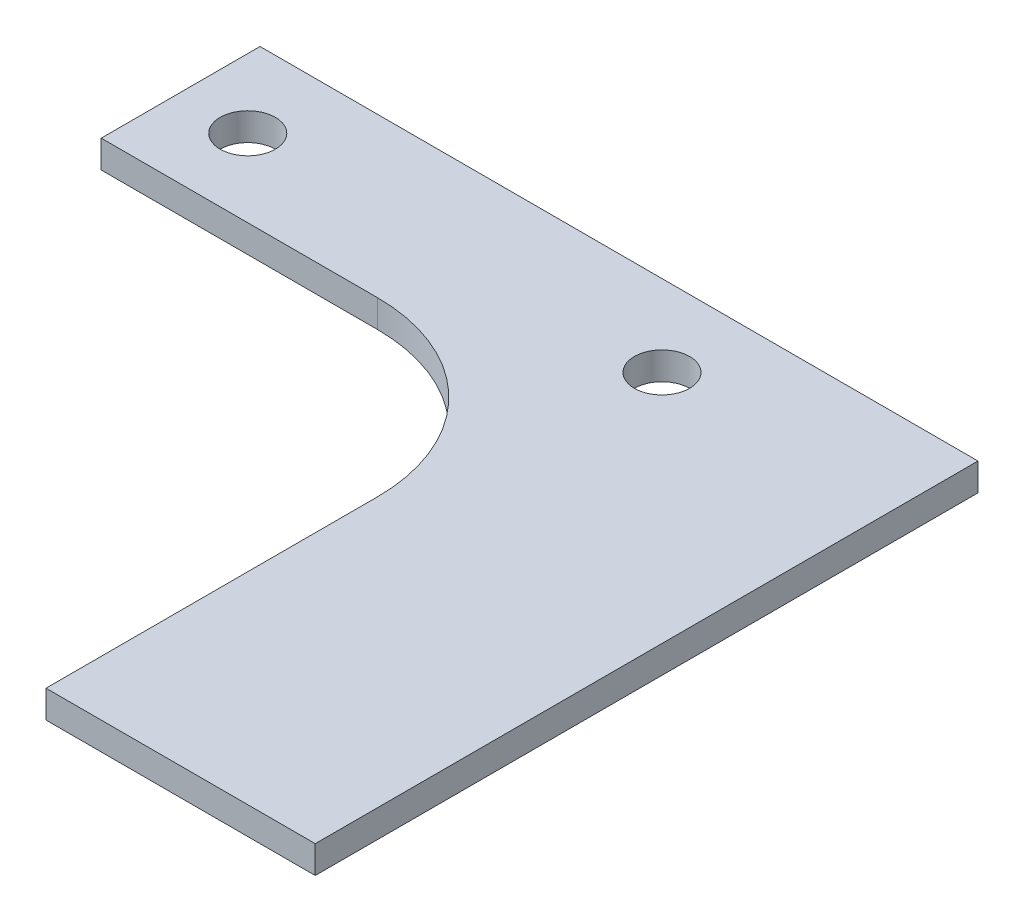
ISO-10303-21;
HEADER;
FILE_DESCRIPTION(('STEP AP214'),'2;1');
FILE_NAME('part.step','',(''),(''),'','','');
FILE_SCHEMA(('AUTOMOTIVE_DESIGN { 1 0 10303 214 1 1 1 1 }'));
ENDSEC;
DATA;
#1=APPLICATION_CONTEXT('core data for automotive mechanical design processes');
#2=APPLICATION_PROTOCOL_DEFINITION('international standard','automotive_design',2000,#1);
#3=PRODUCT_CONTEXT('',#1,'mechanical');
#4=PRODUCT('Part','Part','',(#3));
#5=PRODUCT_RELATED_PRODUCT_CATEGORY('part','',(#4));
#6=PRODUCT_DEFINITION_FORMATION('','',#4);
#7=PRODUCT_DEFINITION_CONTEXT('part definition',#1,'design');
#8=PRODUCT_DEFINITION('design','',#6,#7);
#9=PRODUCT_DEFINITION_SHAPE('','',#8);
#10=(LENGTH_UNIT() NAMED_UNIT(*) SI_UNIT(.MILLI.,.METRE.));
#11=(NAMED_UNIT(*) PLANE_ANGLE_UNIT() SI_UNIT($,.RADIAN.));
#12=(NAMED_UNIT(*) SI_UNIT($,.STERADIAN.) SOLID_ANGLE_UNIT());
#13=UNCERTAINTY_MEASURE_WITH_UNIT(LENGTH_MEASURE(1.E-05),#10,'distance_accuracy_value','');
#14=(GEOMETRIC_REPRESENTATION_CONTEXT(3) GLOBAL_UNCERTAINTY_ASSIGNED_CONTEXT((#13)) GLOBAL_UNIT_ASSIGNED_CONTEXT((#10,
#11,#12)) REPRESENTATION_CONTEXT('',''));
#15=CARTESIAN_POINT('',(0.,0.,0.));
#16=DIRECTION('',(0.,0.,1.));
#17=DIRECTION('',(1.,0.,0.));
#18=AXIS2_PLACEMENT_3D('',#15,#16,#17);
#19=CARTESIAN_POINT('',(25.4,1.5875,-19.05));
#20=DIRECTION('',(-1.,0.,0.));
#21=DIRECTION('',(0.,0.,1.));
#22=AXIS2_PLACEMENT_3D('',#19,#20,#21);
#23=PLANE('',#22);
#24=DIRECTION('',(0.,0.,-1.));
#25=VECTOR('',#24,1.);
#26=CARTESIAN_POINT('',(25.4,1.5875,-19.05));
#27=LINE('',#26,#25);
#28=CARTESIAN_POINT('',(25.4,1.5875,19.0499999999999));
#29=VERTEX_POINT('',#28);
#30=CARTESIAN_POINT('',(25.4,1.5875,-19.05));
#31=VERTEX_POINT('',#30);
#32=EDGE_CURVE('E106',#29,#31,#27,.T.);
#33=ORIENTED_EDGE('',*,*,#32,.F.);
#34=DIRECTION('',(0.,-1.,0.));
#35=VECTOR('',#34,1.);
#36=CARTESIAN_POINT('',(25.4,1.5875,19.0499999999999));
#37=LINE('',#36,#35);
#38=CARTESIAN_POINT('',(25.4,0.,19.0499999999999));
#39=VERTEX_POINT('',#38);
#40=EDGE_CURVE('E131',#29,#39,#37,.T.);
#41=ORIENTED_EDGE('',*,*,#40,.T.);
#42=DIRECTION('',(0.,0.,-1.));
#43=VECTOR('',#42,1.);
#44=CARTESIAN_POINT('',(25.4,0.,-19.05));
#45=LINE('',#44,#43);
#46=CARTESIAN_POINT('',(25.4,0.,-19.05));
#47=VERTEX_POINT('',#46);
#48=EDGE_CURVE('E177',#39,#47,#45,.T.);
#49=ORIENTED_EDGE('',*,*,#48,.T.);
#50=DIRECTION('',(0.,-1.,0.));
#51=VECTOR('',#50,1.);
#52=CARTESIAN_POINT('',(25.4,1.5875,-19.05));
#53=LINE('',#52,#51);
#54=EDGE_CURVE('E11',#31,#47,#53,.T.);
#55=ORIENTED_EDGE('',*,*,#54,.F.);
#56=EDGE_LOOP('',(#33,#41,#49,#55));
#57=FACE_BOUND('',#56,.T.);
#58=ADVANCED_FACE('F42',(#57),#23,.F.);
#59=CARTESIAN_POINT('',(25.4,1.5875,-19.05));
#60=DIRECTION('',(0.,0.,1.));
#61=DIRECTION('',(1.,0.,0.));
#62=AXIS2_PLACEMENT_3D('',#59,#60,#61);
#63=PLANE('',#62);
#64=DIRECTION('',(-1.,0.,0.));
#65=VECTOR('',#64,1.);
#66=CARTESIAN_POINT('',(25.4,0.,-19.05));
#67=LINE('',#66,#65);
#68=CARTESIAN_POINT('',(-15.875,0.,-19.05));
#69=VERTEX_POINT('',#68);
#70=EDGE_CURVE('E174',#47,#69,#67,.T.);
#71=ORIENTED_EDGE('',*,*,#70,.T.);
#72=DIRECTION('',(0.,-1.,0.));
#73=VECTOR('',#72,1.);
#74=CARTESIAN_POINT('',(-15.875,1.5875,-19.05));
#75=LINE('',#74,#73);
#76=CARTESIAN_POINT('',(-15.875,1.5875,-19.05));
#77=VERTEX_POINT('',#76);
#78=EDGE_CURVE('E50',#77,#69,#75,.T.);
#79=ORIENTED_EDGE('',*,*,#78,.F.);
#80=DIRECTION('',(-1.,0.,0.));
#81=VECTOR('',#80,1.);
#82=CARTESIAN_POINT('',(25.4,1.5875,-19.05));
#83=LINE('',#82,#81);
#84=EDGE_CURVE('E148',#31,#77,#83,.T.);
#85=ORIENTED_EDGE('',*,*,#84,.F.);
#86=ORIENTED_EDGE('',*,*,#54,.T.);
#87=EDGE_LOOP('',(#71,#79,#85,#86));
#88=FACE_BOUND('',#87,.T.);
#89=ADVANCED_FACE('F239',(#88),#63,.F.);
#90=CARTESIAN_POINT('',(-15.875,1.5875,-9.921875));
#91=DIRECTION('',(1.,0.,0.));
#92=DIRECTION('',(0.,0.,-1.));
#93=AXIS2_PLACEMENT_3D('',#90,#91,#92);
#94=PLANE('',#93);
#95=DIRECTION('',(0.,0.,1.));
#96=VECTOR('',#95,1.);
#97=CARTESIAN_POINT('',(-15.875,0.,-9.921875));
#98=LINE('',#97,#96);
#99=CARTESIAN_POINT('',(-15.875,0.,-9.921875));
#100=VERTEX_POINT('',#99);
#101=EDGE_CURVE('E151',#69,#100,#98,.T.);
#102=ORIENTED_EDGE('',*,*,#101,.T.);
#103=DIRECTION('',(0.,-1.,0.));
#104=VECTOR('',#103,1.);
#105=CARTESIAN_POINT('',(-15.875,1.5875,-9.921875));
#106=LINE('',#105,#104);
#107=CARTESIAN_POINT('',(-15.875,1.5875,-9.921875));
#108=VERTEX_POINT('',#107);
#109=EDGE_CURVE('E157',#108,#100,#106,.T.);
#110=ORIENTED_EDGE('',*,*,#109,.F.);
#111=DIRECTION('',(0.,0.,1.));
#112=VECTOR('',#111,1.);
#113=CARTESIAN_POINT('',(-15.875,1.5875,-9.921875));
#114=LINE('',#113,#112);
#115=EDGE_CURVE('E171',#77,#108,#114,.T.);
#116=ORIENTED_EDGE('',*,*,#115,.F.);
#117=ORIENTED_EDGE('',*,*,#78,.T.);
#118=EDGE_LOOP('',(#102,#110,#116,#117));
#119=FACE_BOUND('',#118,.T.);
#120=ADVANCED_FACE('F169',(#119),#94,.F.);
#121=CARTESIAN_POINT('',(0.,1.5875,-9.921875));
#122=DIRECTION('',(0.,0.,-1.));
#123=DIRECTION('',(-1.,0.,0.));
#124=AXIS2_PLACEMENT_3D('',#121,#122,#123);
#125=PLANE('',#124);
#126=DIRECTION('',(1.,0.,0.));
#127=VECTOR('',#126,1.);
#128=CARTESIAN_POINT('',(0.,0.,-9.921875));
#129=LINE('',#128,#127);
#130=CARTESIAN_POINT('',(0.,0.,-9.921875));
#131=VERTEX_POINT('',#130);
#132=EDGE_CURVE('E144',#100,#131,#129,.T.);
#133=ORIENTED_EDGE('',*,*,#132,.T.);
#134=DIRECTION('',(0.,-1.,0.));
#135=VECTOR('',#134,1.);
#136=CARTESIAN_POINT('',(0.,1.5875,-9.921875));
#137=LINE('',#136,#135);
#138=CARTESIAN_POINT('',(0.,1.5875,-9.921875));
#139=VERTEX_POINT('',#138);
#140=EDGE_CURVE('E142',#139,#131,#137,.T.);
#141=ORIENTED_EDGE('',*,*,#140,.F.);
#142=DIRECTION('',(1.,0.,0.));
#143=VECTOR('',#142,1.);
#144=CARTESIAN_POINT('',(0.,1.5875,-9.921875));
#145=LINE('',#144,#143);
#146=EDGE_CURVE('E71',#108,#139,#145,.T.);
#147=ORIENTED_EDGE('',*,*,#146,.F.);
#148=ORIENTED_EDGE('',*,*,#109,.T.);
#149=EDGE_LOOP('',(#133,#141,#147,#148));
#150=FACE_BOUND('',#149,.T.);
#151=ADVANCED_FACE('F246',(#150),#125,.F.);
#152=CARTESIAN_POINT('',(0.,1.5875,0.));
#153=DIRECTION('',(0.,-1.,0.));
#154=DIRECTION('',(0.,0.,-1.));
#155=AXIS2_PLACEMENT_3D('',#152,#153,#154);
#156=CYLINDRICAL_SURFACE('',#155,9.921875);
#157=CARTESIAN_POINT('',(0.,0.,0.));
#158=DIRECTION('',(0.,-1.,0.));
#159=DIRECTION('',(0.,0.,1.));
#160=AXIS2_PLACEMENT_3D('',#157,#158,#159);
#161=CIRCLE('',#160,9.921875);
#162=CARTESIAN_POINT('',(9.921875,0.,0.));
#163=VERTEX_POINT('',#162);
#164=EDGE_CURVE('E97',#131,#163,#161,.T.);
#165=ORIENTED_EDGE('',*,*,#164,.T.);
#166=DIRECTION('',(0.,1.,0.));
#167=VECTOR('',#166,1.);
#168=CARTESIAN_POINT('',(9.921875,0.,0.));
#169=LINE('',#168,#167);
#170=CARTESIAN_POINT('',(9.921875,1.5875,0.));
#171=VERTEX_POINT('',#170);
#172=EDGE_CURVE('E124',#163,#171,#169,.T.);
#173=ORIENTED_EDGE('',*,*,#172,.T.);
#174=CARTESIAN_POINT('',(0.,1.5875,0.));
#175=DIRECTION('',(0.,-1.,0.));
#176=DIRECTION('',(0.,0.,1.));
#177=AXIS2_PLACEMENT_3D('',#174,#175,#176);
#178=CIRCLE('',#177,9.921875);
#179=EDGE_CURVE('E158',#139,#171,#178,.T.);
#180=ORIENTED_EDGE('',*,*,#179,.F.);
#181=ORIENTED_EDGE('',*,*,#140,.T.);
#182=EDGE_LOOP('',(#165,#173,#180,#181));
#183=FACE_BOUND('',#182,.T.);
#184=ADVANCED_FACE('F141',(#183),#156,.F.);
#185=CARTESIAN_POINT('',(0.,1.5875,0.));
#186=DIRECTION('',(0.,1.,0.));
#187=DIRECTION('',(0.,0.,1.));
#188=AXIS2_PLACEMENT_3D('',#185,#186,#187);
#189=PLANE('',#188);
#190=DIRECTION('',(0.,0.,-1.));
#191=VECTOR('',#190,1.);
#192=CARTESIAN_POINT('',(9.921875,1.5875,0.));
#193=LINE('',#192,#191);
#194=CARTESIAN_POINT('',(9.92187500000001,1.5875,19.0499999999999));
#195=VERTEX_POINT('',#194);
#196=EDGE_CURVE('E127',#195,#171,#193,.T.);
#197=ORIENTED_EDGE('',*,*,#196,.F.);
#198=DIRECTION('',(-1.,0.,0.));
#199=VECTOR('',#198,1.);
#200=CARTESIAN_POINT('',(31.7053948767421,1.5875,19.0499999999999));
#201=LINE('',#200,#199);
#202=EDGE_CURVE('E210',#29,#195,#201,.T.);
#203=ORIENTED_EDGE('',*,*,#202,.F.);
#204=ORIENTED_EDGE('',*,*,#32,.T.);
#205=ORIENTED_EDGE('',*,*,#84,.T.);
#206=ORIENTED_EDGE('',*,*,#115,.T.);
#207=ORIENTED_EDGE('',*,*,#146,.T.);
#208=ORIENTED_EDGE('',*,*,#179,.T.);
#209=EDGE_LOOP('',(#197,#203,#204,#205,#206,#207,#208));
#210=FACE_BOUND('',#209,.T.);
#211=CARTESIAN_POINT('',(-11.90625,1.5875,-14.3764));
#212=DIRECTION('',(0.,1.,0.));
#213=DIRECTION('',(0.,0.,1.));
#214=AXIS2_PLACEMENT_3D('',#211,#212,#213);
#215=CIRCLE('',#214,1.5875);
#216=CARTESIAN_POINT('',(-11.90625,1.5875,-12.7889));
#217=VERTEX_POINT('',#216);
#218=EDGE_CURVE('E197',#217,#217,#215,.T.);
#219=ORIENTED_EDGE('',*,*,#218,.F.);
#220=EDGE_LOOP('',(#219));
#221=FACE_BOUND('',#220,.T.);
#222=CARTESIAN_POINT('',(11.90625,1.5875,-14.3764));
#223=DIRECTION('',(0.,1.,0.));
#224=DIRECTION('',(0.,0.,1.));
#225=AXIS2_PLACEMENT_3D('',#222,#223,#224);
#226=CIRCLE('',#225,1.5875);
#227=CARTESIAN_POINT('',(11.90625,1.5875,-12.7889));
#228=VERTEX_POINT('',#227);
#229=EDGE_CURVE('E190',#228,#228,#226,.T.);
#230=ORIENTED_EDGE('',*,*,#229,.F.);
#231=EDGE_LOOP('',(#230));
#232=FACE_BOUND('',#231,.T.);
#233=ADVANCED_FACE('F216',(#210,#221,#232),#189,.T.);
#234=CARTESIAN_POINT('',(0.,0.,0.));
#235=DIRECTION('',(0.,1.,0.));
#236=DIRECTION('',(0.,0.,1.));
#237=AXIS2_PLACEMENT_3D('',#234,#235,#236);
#238=PLANE('',#237);
#239=CARTESIAN_POINT('',(-11.90625,0.,-14.3764));
#240=DIRECTION('',(0.,1.,0.));
#241=DIRECTION('',(0.,0.,1.));
#242=AXIS2_PLACEMENT_3D('',#239,#240,#241);
#243=CIRCLE('',#242,1.5875);
#244=CARTESIAN_POINT('',(-11.90625,0.,-12.7889));
#245=VERTEX_POINT('',#244);
#246=EDGE_CURVE('E193',#245,#245,#243,.T.);
#247=ORIENTED_EDGE('',*,*,#246,.T.);
#248=EDGE_LOOP('',(#247));
#249=FACE_BOUND('',#248,.T.);
#250=CARTESIAN_POINT('',(11.90625,0.,-14.3764));
#251=DIRECTION('',(0.,1.,0.));
#252=DIRECTION('',(0.,0.,1.));
#253=AXIS2_PLACEMENT_3D('',#250,#251,#252);
#254=CIRCLE('',#253,1.5875);
#255=CARTESIAN_POINT('',(11.90625,0.,-12.7889));
#256=VERTEX_POINT('',#255);
#257=EDGE_CURVE('E182',#256,#256,#254,.T.);
#258=ORIENTED_EDGE('',*,*,#257,.T.);
#259=EDGE_LOOP('',(#258));
#260=FACE_BOUND('',#259,.T.);
#261=DIRECTION('',(-1.,0.,0.));
#262=VECTOR('',#261,1.);
#263=CARTESIAN_POINT('',(31.7053948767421,0.,19.0499999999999));
#264=LINE('',#263,#262);
#265=CARTESIAN_POINT('',(9.92187500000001,0.,19.0499999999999));
#266=VERTEX_POINT('',#265);
#267=EDGE_CURVE('E137',#39,#266,#264,.T.);
#268=ORIENTED_EDGE('',*,*,#267,.T.);
#269=DIRECTION('',(0.,0.,-1.));
#270=VECTOR('',#269,1.);
#271=CARTESIAN_POINT('',(9.921875,0.,0.));
#272=LINE('',#271,#270);
#273=EDGE_CURVE('E60',#266,#163,#272,.T.);
#274=ORIENTED_EDGE('',*,*,#273,.T.);
#275=ORIENTED_EDGE('',*,*,#164,.F.);
#276=ORIENTED_EDGE('',*,*,#132,.F.);
#277=ORIENTED_EDGE('',*,*,#101,.F.);
#278=ORIENTED_EDGE('',*,*,#70,.F.);
#279=ORIENTED_EDGE('',*,*,#48,.F.);
#280=EDGE_LOOP('',(#268,#274,#275,#276,#277,#278,#279));
#281=FACE_BOUND('',#280,.T.);
#282=ADVANCED_FACE('F135',(#249,#260,#281),#238,.F.);
#283=CARTESIAN_POINT('',(11.90625,0.,-14.3764));
#284=DIRECTION('',(0.,1.,0.));
#285=DIRECTION('',(0.,0.,1.));
#286=AXIS2_PLACEMENT_3D('',#283,#284,#285);
#287=CYLINDRICAL_SURFACE('',#286,1.5875);
#288=ORIENTED_EDGE('',*,*,#257,.F.);
#289=EDGE_LOOP('',(#288));
#290=FACE_BOUND('',#289,.T.);
#291=ORIENTED_EDGE('',*,*,#229,.T.);
#292=EDGE_LOOP('',(#291));
#293=FACE_BOUND('',#292,.T.);
#294=ADVANCED_FACE('F224',(#290,#293),#287,.F.);
#295=CARTESIAN_POINT('',(-11.90625,0.,-14.3764));
#296=DIRECTION('',(0.,1.,0.));
#297=DIRECTION('',(0.,0.,1.));
#298=AXIS2_PLACEMENT_3D('',#295,#296,#297);
#299=CYLINDRICAL_SURFACE('',#298,1.5875);
#300=ORIENTED_EDGE('',*,*,#246,.F.);
#301=EDGE_LOOP('',(#300));
#302=FACE_BOUND('',#301,.T.);
#303=ORIENTED_EDGE('',*,*,#218,.T.);
#304=EDGE_LOOP('',(#303));
#305=FACE_BOUND('',#304,.T.);
#306=ADVANCED_FACE('F226',(#302,#305),#299,.F.);
#307=CARTESIAN_POINT('',(31.7053948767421,0.,19.0499999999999));
#308=DIRECTION('',(0.,0.,-1.));
#309=DIRECTION('',(-1.,0.,0.));
#310=AXIS2_PLACEMENT_3D('',#307,#308,#309);
#311=PLANE('',#310);
#312=ORIENTED_EDGE('',*,*,#202,.T.);
#313=DIRECTION('',(0.,1.,0.));
#314=VECTOR('',#313,1.);
#315=CARTESIAN_POINT('',(9.92187500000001,0.,19.0499999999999));
#316=LINE('',#315,#314);
#317=EDGE_CURVE('E132',#266,#195,#316,.T.);
#318=ORIENTED_EDGE('',*,*,#317,.F.);
#319=ORIENTED_EDGE('',*,*,#267,.F.);
#320=ORIENTED_EDGE('',*,*,#40,.F.);
#321=EDGE_LOOP('',(#312,#318,#319,#320));
#322=FACE_BOUND('',#321,.T.);
#323=ADVANCED_FACE('F215',(#322),#311,.F.);
#324=CARTESIAN_POINT('',(9.921875,0.,0.));
#325=DIRECTION('',(1.,0.,0.));
#326=DIRECTION('',(0.,0.,-1.));
#327=AXIS2_PLACEMENT_3D('',#324,#325,#326);
#328=PLANE('',#327);
#329=ORIENTED_EDGE('',*,*,#196,.T.);
#330=ORIENTED_EDGE('',*,*,#172,.F.);
#331=ORIENTED_EDGE('',*,*,#273,.F.);
#332=ORIENTED_EDGE('',*,*,#317,.T.);
#333=EDGE_LOOP('',(#329,#330,#331,#332));
#334=FACE_BOUND('',#333,.T.);
#335=ADVANCED_FACE('F125',(#334),#328,.F.);
#336=CLOSED_SHELL('',(#58,#89,#120,#151,#184,#233,#282,#294,#306,#323,#335));
#337=MANIFOLD_SOLID_BREP('B2',#336);
#338=ADVANCED_BREP_SHAPE_REPRESENTATION('',(#18,#337),#14);
#339=SHAPE_DEFINITION_REPRESENTATION(#9,#338);
ENDSEC;
END-ISO-10303-21;
